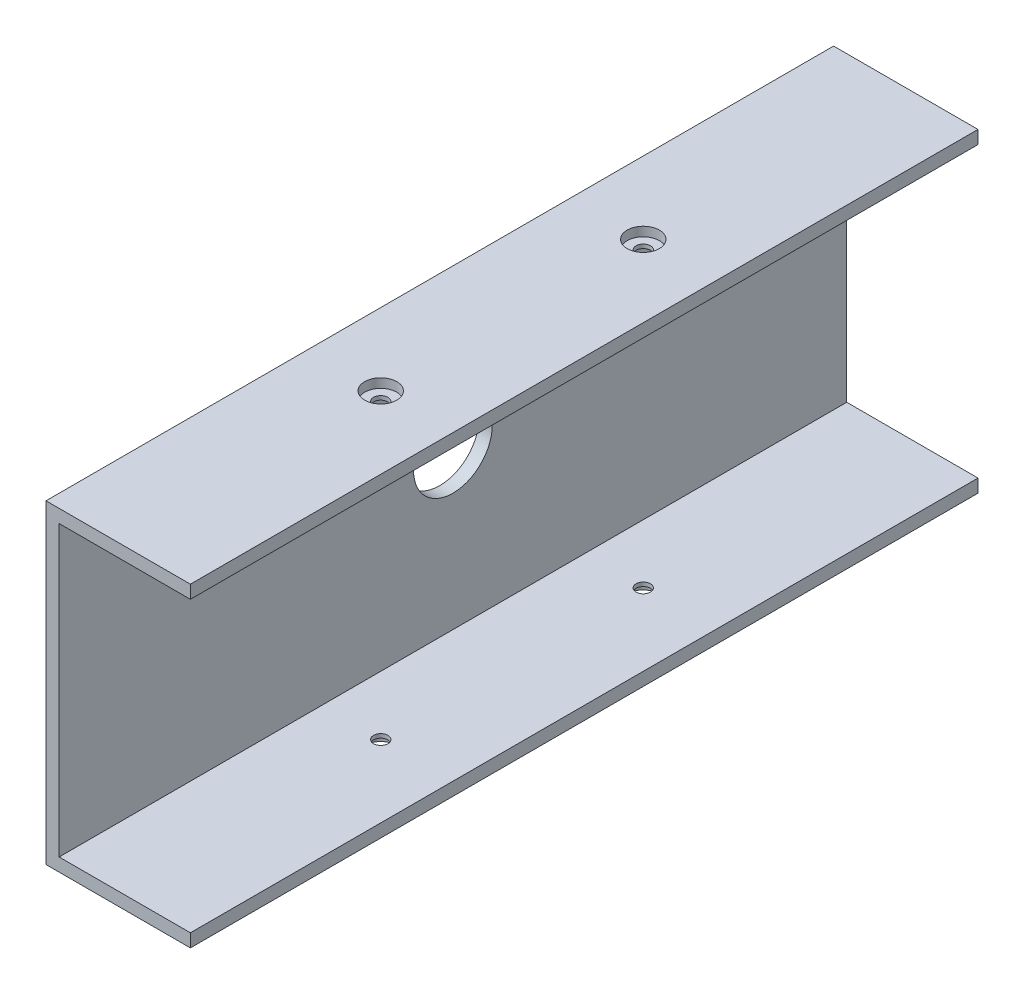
ISO-10303-21;
HEADER;
FILE_DESCRIPTION(('STEP AP214'),'2;1');
FILE_NAME('part.step','',(''),(''),'','','');
FILE_SCHEMA(('AUTOMOTIVE_DESIGN { 1 0 10303 214 1 1 1 1 }'));
ENDSEC;
DATA;
#1=APPLICATION_CONTEXT('core data for automotive mechanical design processes');
#2=APPLICATION_PROTOCOL_DEFINITION('international standard','automotive_design',2000,#1);
#3=PRODUCT_CONTEXT('',#1,'mechanical');
#4=PRODUCT('Part','Part','',(#3));
#5=PRODUCT_RELATED_PRODUCT_CATEGORY('part','',(#4));
#6=PRODUCT_DEFINITION_FORMATION('','',#4);
#7=PRODUCT_DEFINITION_CONTEXT('part definition',#1,'design');
#8=PRODUCT_DEFINITION('design','',#6,#7);
#9=PRODUCT_DEFINITION_SHAPE('','',#8);
#10=(LENGTH_UNIT() NAMED_UNIT(*) SI_UNIT(.MILLI.,.METRE.));
#11=(NAMED_UNIT(*) PLANE_ANGLE_UNIT() SI_UNIT($,.RADIAN.));
#12=(NAMED_UNIT(*) SI_UNIT($,.STERADIAN.) SOLID_ANGLE_UNIT());
#13=UNCERTAINTY_MEASURE_WITH_UNIT(LENGTH_MEASURE(1.E-05),#10,'distance_accuracy_value','');
#14=(GEOMETRIC_REPRESENTATION_CONTEXT(3) GLOBAL_UNCERTAINTY_ASSIGNED_CONTEXT((#13)) GLOBAL_UNIT_ASSIGNED_CONTEXT((#10,
#11,#12)) REPRESENTATION_CONTEXT('',''));
#15=CARTESIAN_POINT('',(0.,0.,0.));
#16=DIRECTION('',(0.,0.,1.));
#17=DIRECTION('',(1.,0.,0.));
#18=AXIS2_PLACEMENT_3D('',#15,#16,#17);
#19=CARTESIAN_POINT('',(-64.668520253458,-52.1779141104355,300.));
#20=DIRECTION('',(1.,0.,0.));
#21=DIRECTION('',(0.,1.,0.));
#22=AXIS2_PLACEMENT_3D('',#19,#20,#21);
#23=PLANE('',#22);
#24=CARTESIAN_POINT('',(-64.668520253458,12.8220858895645,150.));
#25=DIRECTION('',(-1.,0.,0.));
#26=DIRECTION('',(0.,-1.,0.));
#27=AXIS2_PLACEMENT_3D('',#24,#25,#26);
#28=CIRCLE('',#27,15.);
#29=CARTESIAN_POINT('',(-64.668520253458,-2.17791411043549,150.));
#30=VERTEX_POINT('',#29);
#31=EDGE_CURVE('E241',#30,#30,#28,.T.);
#32=ORIENTED_EDGE('',*,*,#31,.F.);
#33=EDGE_LOOP('',(#32));
#34=FACE_BOUND('',#33,.T.);
#35=DIRECTION('',(0.,-1.,0.));
#36=VECTOR('',#35,1.);
#37=CARTESIAN_POINT('',(-64.668520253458,-52.1779141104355,0.));
#38=LINE('',#37,#36);
#39=CARTESIAN_POINT('',(-64.668520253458,67.8220858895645,0.));
#40=VERTEX_POINT('',#39);
#41=CARTESIAN_POINT('',(-64.668520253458,-52.1779141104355,0.));
#42=VERTEX_POINT('',#41);
#43=EDGE_CURVE('E132',#40,#42,#38,.T.);
#44=ORIENTED_EDGE('',*,*,#43,.T.);
#45=DIRECTION('',(0.,0.,-1.));
#46=VECTOR('',#45,1.);
#47=CARTESIAN_POINT('',(-64.668520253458,-52.1779141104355,300.));
#48=LINE('',#47,#46);
#49=CARTESIAN_POINT('',(-64.668520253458,-52.1779141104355,300.));
#50=VERTEX_POINT('',#49);
#51=EDGE_CURVE('E11',#50,#42,#48,.T.);
#52=ORIENTED_EDGE('',*,*,#51,.F.);
#53=DIRECTION('',(0.,-1.,0.));
#54=VECTOR('',#53,1.);
#55=CARTESIAN_POINT('',(-64.668520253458,-52.1779141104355,300.));
#56=LINE('',#55,#54);
#57=CARTESIAN_POINT('',(-64.668520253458,67.8220858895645,300.));
#58=VERTEX_POINT('',#57);
#59=EDGE_CURVE('E147',#58,#50,#56,.T.);
#60=ORIENTED_EDGE('',*,*,#59,.F.);
#61=DIRECTION('',(0.,0.,-1.));
#62=VECTOR('',#61,1.);
#63=CARTESIAN_POINT('',(-64.668520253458,67.8220858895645,300.));
#64=LINE('',#63,#62);
#65=EDGE_CURVE('E128',#58,#40,#64,.T.);
#66=ORIENTED_EDGE('',*,*,#65,.T.);
#67=EDGE_LOOP('',(#44,#52,#60,#66));
#68=FACE_BOUND('',#67,.T.);
#69=ADVANCED_FACE('F34',(#34,#68),#23,.F.);
#70=CARTESIAN_POINT('',(-9.66852025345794,-52.1779141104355,300.));
#71=DIRECTION('',(0.,1.,0.));
#72=DIRECTION('',(-1.,0.,0.));
#73=AXIS2_PLACEMENT_3D('',#70,#71,#72);
#74=PLANE('',#73);
#75=CARTESIAN_POINT('',(-37.1685202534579,-52.1779141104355,100.));
#76=DIRECTION('',(0.,-1.,0.));
#77=DIRECTION('',(0.,0.,-1.));
#78=AXIS2_PLACEMENT_3D('',#75,#76,#77);
#79=CIRCLE('',#78,6.119);
#80=CARTESIAN_POINT('',(-37.1685202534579,-52.1779141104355,93.881));
#81=VERTEX_POINT('',#80);
#82=EDGE_CURVE('E245',#81,#81,#79,.T.);
#83=ORIENTED_EDGE('',*,*,#82,.F.);
#84=EDGE_LOOP('',(#83));
#85=FACE_BOUND('',#84,.T.);
#86=CARTESIAN_POINT('',(-37.1685202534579,-52.1779141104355,200.));
#87=DIRECTION('',(0.,-1.,0.));
#88=DIRECTION('',(0.,0.,-1.));
#89=AXIS2_PLACEMENT_3D('',#86,#87,#88);
#90=CIRCLE('',#89,6.119);
#91=CARTESIAN_POINT('',(-37.1685202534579,-52.1779141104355,193.881));
#92=VERTEX_POINT('',#91);
#93=EDGE_CURVE('E176',#92,#92,#90,.T.);
#94=ORIENTED_EDGE('',*,*,#93,.F.);
#95=EDGE_LOOP('',(#94));
#96=FACE_BOUND('',#95,.T.);
#97=DIRECTION('',(1.,0.,0.));
#98=VECTOR('',#97,1.);
#99=CARTESIAN_POINT('',(-9.66852025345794,-52.1779141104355,0.));
#100=LINE('',#99,#98);
#101=CARTESIAN_POINT('',(-9.66852025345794,-52.1779141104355,0.));
#102=VERTEX_POINT('',#101);
#103=EDGE_CURVE('E135',#42,#102,#100,.T.);
#104=ORIENTED_EDGE('',*,*,#103,.T.);
#105=DIRECTION('',(0.,0.,-1.));
#106=VECTOR('',#105,1.);
#107=CARTESIAN_POINT('',(-9.66852025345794,-52.1779141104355,300.));
#108=LINE('',#107,#106);
#109=CARTESIAN_POINT('',(-9.66852025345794,-52.1779141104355,300.));
#110=VERTEX_POINT('',#109);
#111=EDGE_CURVE('E43',#110,#102,#108,.T.);
#112=ORIENTED_EDGE('',*,*,#111,.F.);
#113=DIRECTION('',(1.,0.,0.));
#114=VECTOR('',#113,1.);
#115=CARTESIAN_POINT('',(-9.66852025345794,-52.1779141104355,300.));
#116=LINE('',#115,#114);
#117=EDGE_CURVE('E95',#50,#110,#116,.T.);
#118=ORIENTED_EDGE('',*,*,#117,.F.);
#119=ORIENTED_EDGE('',*,*,#51,.T.);
#120=EDGE_LOOP('',(#104,#112,#118,#119));
#121=FACE_BOUND('',#120,.T.);
#122=ADVANCED_FACE('F232',(#85,#96,#121),#74,.F.);
#123=CARTESIAN_POINT('',(-9.66852025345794,-47.1779141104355,300.));
#124=DIRECTION('',(-1.,0.,0.));
#125=DIRECTION('',(0.,0.,1.));
#126=AXIS2_PLACEMENT_3D('',#123,#124,#125);
#127=PLANE('',#126);
#128=DIRECTION('',(0.,1.,0.));
#129=VECTOR('',#128,1.);
#130=CARTESIAN_POINT('',(-9.66852025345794,-47.1779141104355,0.));
#131=LINE('',#130,#129);
#132=CARTESIAN_POINT('',(-9.66852025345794,-47.1779141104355,0.));
#133=VERTEX_POINT('',#132);
#134=EDGE_CURVE('E138',#102,#133,#131,.T.);
#135=ORIENTED_EDGE('',*,*,#134,.T.);
#136=DIRECTION('',(0.,0.,-1.));
#137=VECTOR('',#136,1.);
#138=CARTESIAN_POINT('',(-9.66852025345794,-47.1779141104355,300.));
#139=LINE('',#138,#137);
#140=CARTESIAN_POINT('',(-9.66852025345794,-47.1779141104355,300.));
#141=VERTEX_POINT('',#140);
#142=EDGE_CURVE('E154',#141,#133,#139,.T.);
#143=ORIENTED_EDGE('',*,*,#142,.F.);
#144=DIRECTION('',(0.,1.,0.));
#145=VECTOR('',#144,1.);
#146=CARTESIAN_POINT('',(-9.66852025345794,-47.1779141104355,300.));
#147=LINE('',#146,#145);
#148=EDGE_CURVE('E198',#110,#141,#147,.T.);
#149=ORIENTED_EDGE('',*,*,#148,.F.);
#150=ORIENTED_EDGE('',*,*,#111,.T.);
#151=EDGE_LOOP('',(#135,#143,#149,#150));
#152=FACE_BOUND('',#151,.T.);
#153=ADVANCED_FACE('F237',(#152),#127,.F.);
#154=CARTESIAN_POINT('',(-59.6685202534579,-47.1779141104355,300.));
#155=DIRECTION('',(0.,-1.,0.));
#156=DIRECTION('',(0.,0.,-1.));
#157=AXIS2_PLACEMENT_3D('',#154,#155,#156);
#158=PLANE('',#157);
#159=CARTESIAN_POINT('',(-37.1685202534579,-47.1779141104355,100.));
#160=DIRECTION('',(0.,-1.,0.));
#161=DIRECTION('',(0.,0.,-1.));
#162=AXIS2_PLACEMENT_3D('',#159,#160,#161);
#163=CIRCLE('',#162,2.75);
#164=CARTESIAN_POINT('',(-37.1685202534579,-47.1779141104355,97.25));
#165=VERTEX_POINT('',#164);
#166=EDGE_CURVE('E249',#165,#165,#163,.T.);
#167=ORIENTED_EDGE('',*,*,#166,.T.);
#168=EDGE_LOOP('',(#167));
#169=FACE_BOUND('',#168,.T.);
#170=CARTESIAN_POINT('',(-37.1685202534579,-47.1779141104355,200.));
#171=DIRECTION('',(0.,-1.,0.));
#172=DIRECTION('',(0.,0.,-1.));
#173=AXIS2_PLACEMENT_3D('',#170,#171,#172);
#174=CIRCLE('',#173,2.75);
#175=CARTESIAN_POINT('',(-37.1685202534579,-47.1779141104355,197.25));
#176=VERTEX_POINT('',#175);
#177=EDGE_CURVE('E161',#176,#176,#174,.T.);
#178=ORIENTED_EDGE('',*,*,#177,.T.);
#179=EDGE_LOOP('',(#178));
#180=FACE_BOUND('',#179,.T.);
#181=DIRECTION('',(-1.,0.,0.));
#182=VECTOR('',#181,1.);
#183=CARTESIAN_POINT('',(-59.6685202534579,-47.1779141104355,0.));
#184=LINE('',#183,#182);
#185=CARTESIAN_POINT('',(-59.6685202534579,-47.1779141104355,0.));
#186=VERTEX_POINT('',#185);
#187=EDGE_CURVE('E140',#133,#186,#184,.T.);
#188=ORIENTED_EDGE('',*,*,#187,.T.);
#189=DIRECTION('',(0.,0.,-1.));
#190=VECTOR('',#189,1.);
#191=CARTESIAN_POINT('',(-59.6685202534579,-47.1779141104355,300.));
#192=LINE('',#191,#190);
#193=CARTESIAN_POINT('',(-59.6685202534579,-47.1779141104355,300.));
#194=VERTEX_POINT('',#193);
#195=EDGE_CURVE('E151',#194,#186,#192,.T.);
#196=ORIENTED_EDGE('',*,*,#195,.F.);
#197=DIRECTION('',(-1.,0.,0.));
#198=VECTOR('',#197,1.);
#199=CARTESIAN_POINT('',(-59.6685202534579,-47.1779141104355,300.));
#200=LINE('',#199,#198);
#201=EDGE_CURVE('E200',#141,#194,#200,.T.);
#202=ORIENTED_EDGE('',*,*,#201,.F.);
#203=ORIENTED_EDGE('',*,*,#142,.T.);
#204=EDGE_LOOP('',(#188,#196,#202,#203));
#205=FACE_BOUND('',#204,.T.);
#206=ADVANCED_FACE('F206',(#169,#180,#205),#158,.F.);
#207=CARTESIAN_POINT('',(-59.6685202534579,62.8220858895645,300.));
#208=DIRECTION('',(-1.,0.,0.));
#209=DIRECTION('',(0.,-1.,0.));
#210=AXIS2_PLACEMENT_3D('',#207,#208,#209);
#211=PLANE('',#210);
#212=CARTESIAN_POINT('',(-59.6685202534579,12.8220858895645,150.));
#213=DIRECTION('',(-1.,0.,0.));
#214=DIRECTION('',(0.,-1.,0.));
#215=AXIS2_PLACEMENT_3D('',#212,#213,#214);
#216=CIRCLE('',#215,15.);
#217=CARTESIAN_POINT('',(-59.6685202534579,-2.17791411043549,150.));
#218=VERTEX_POINT('',#217);
#219=EDGE_CURVE('E37',#218,#218,#216,.T.);
#220=ORIENTED_EDGE('',*,*,#219,.T.);
#221=EDGE_LOOP('',(#220));
#222=FACE_BOUND('',#221,.T.);
#223=DIRECTION('',(0.,1.,0.));
#224=VECTOR('',#223,1.);
#225=CARTESIAN_POINT('',(-59.6685202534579,62.8220858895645,0.));
#226=LINE('',#225,#224);
#227=CARTESIAN_POINT('',(-59.6685202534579,62.8220858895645,0.));
#228=VERTEX_POINT('',#227);
#229=EDGE_CURVE('E142',#186,#228,#226,.T.);
#230=ORIENTED_EDGE('',*,*,#229,.T.);
#231=DIRECTION('',(0.,0.,-1.));
#232=VECTOR('',#231,1.);
#233=CARTESIAN_POINT('',(-59.6685202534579,62.8220858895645,300.));
#234=LINE('',#233,#232);
#235=CARTESIAN_POINT('',(-59.6685202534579,62.8220858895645,300.));
#236=VERTEX_POINT('',#235);
#237=EDGE_CURVE('E123',#236,#228,#234,.T.);
#238=ORIENTED_EDGE('',*,*,#237,.F.);
#239=DIRECTION('',(0.,1.,0.));
#240=VECTOR('',#239,1.);
#241=CARTESIAN_POINT('',(-59.6685202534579,62.8220858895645,300.));
#242=LINE('',#241,#240);
#243=EDGE_CURVE('E114',#194,#236,#242,.T.);
#244=ORIENTED_EDGE('',*,*,#243,.F.);
#245=ORIENTED_EDGE('',*,*,#195,.T.);
#246=EDGE_LOOP('',(#230,#238,#244,#245));
#247=FACE_BOUND('',#246,.T.);
#248=ADVANCED_FACE('F210',(#222,#247),#211,.F.);
#249=CARTESIAN_POINT('',(-9.66852025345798,62.8220858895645,300.));
#250=DIRECTION('',(0.,1.,0.));
#251=DIRECTION('',(-1.,0.,0.));
#252=AXIS2_PLACEMENT_3D('',#249,#250,#251);
#253=PLANE('',#252);
#254=CARTESIAN_POINT('',(-37.168520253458,62.8220858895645,100.));
#255=DIRECTION('',(0.,1.,0.));
#256=DIRECTION('',(-1.,0.,0.));
#257=AXIS2_PLACEMENT_3D('',#254,#255,#256);
#258=CIRCLE('',#257,2.75);
#259=CARTESIAN_POINT('',(-39.918520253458,62.8220858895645,100.));
#260=VERTEX_POINT('',#259);
#261=EDGE_CURVE('E168',#260,#260,#258,.T.);
#262=ORIENTED_EDGE('',*,*,#261,.T.);
#263=EDGE_LOOP('',(#262));
#264=FACE_BOUND('',#263,.T.);
#265=CARTESIAN_POINT('',(-37.168520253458,62.8220858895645,200.));
#266=DIRECTION('',(0.,1.,0.));
#267=DIRECTION('',(-1.,0.,0.));
#268=AXIS2_PLACEMENT_3D('',#265,#266,#267);
#269=CIRCLE('',#268,2.75);
#270=CARTESIAN_POINT('',(-39.918520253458,62.8220858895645,200.));
#271=VERTEX_POINT('',#270);
#272=EDGE_CURVE('E136',#271,#271,#269,.T.);
#273=ORIENTED_EDGE('',*,*,#272,.T.);
#274=EDGE_LOOP('',(#273));
#275=FACE_BOUND('',#274,.T.);
#276=DIRECTION('',(1.,0.,0.));
#277=VECTOR('',#276,1.);
#278=CARTESIAN_POINT('',(-9.66852025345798,62.8220858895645,0.));
#279=LINE('',#278,#277);
#280=CARTESIAN_POINT('',(-9.66852025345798,62.8220858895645,0.));
#281=VERTEX_POINT('',#280);
#282=EDGE_CURVE('E122',#228,#281,#279,.T.);
#283=ORIENTED_EDGE('',*,*,#282,.T.);
#284=DIRECTION('',(0.,0.,-1.));
#285=VECTOR('',#284,1.);
#286=CARTESIAN_POINT('',(-9.66852025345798,62.8220858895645,300.));
#287=LINE('',#286,#285);
#288=CARTESIAN_POINT('',(-9.66852025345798,62.8220858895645,300.));
#289=VERTEX_POINT('',#288);
#290=EDGE_CURVE('E119',#289,#281,#287,.T.);
#291=ORIENTED_EDGE('',*,*,#290,.F.);
#292=DIRECTION('',(1.,0.,0.));
#293=VECTOR('',#292,1.);
#294=CARTESIAN_POINT('',(-9.66852025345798,62.8220858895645,300.));
#295=LINE('',#294,#293);
#296=EDGE_CURVE('E108',#236,#289,#295,.T.);
#297=ORIENTED_EDGE('',*,*,#296,.F.);
#298=ORIENTED_EDGE('',*,*,#237,.T.);
#299=EDGE_LOOP('',(#283,#291,#297,#298));
#300=FACE_BOUND('',#299,.T.);
#301=ADVANCED_FACE('F120',(#264,#275,#300),#253,.F.);
#302=CARTESIAN_POINT('',(-9.66852025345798,67.8220858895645,300.));
#303=DIRECTION('',(-1.,0.,0.));
#304=DIRECTION('',(0.,0.,1.));
#305=AXIS2_PLACEMENT_3D('',#302,#303,#304);
#306=PLANE('',#305);
#307=DIRECTION('',(0.,1.,0.));
#308=VECTOR('',#307,1.);
#309=CARTESIAN_POINT('',(-9.66852025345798,67.8220858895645,0.));
#310=LINE('',#309,#308);
#311=CARTESIAN_POINT('',(-9.66852025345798,67.8220858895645,0.));
#312=VERTEX_POINT('',#311);
#313=EDGE_CURVE('E81',#281,#312,#310,.T.);
#314=ORIENTED_EDGE('',*,*,#313,.T.);
#315=DIRECTION('',(0.,0.,-1.));
#316=VECTOR('',#315,1.);
#317=CARTESIAN_POINT('',(-9.66852025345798,67.8220858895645,300.));
#318=LINE('',#317,#316);
#319=CARTESIAN_POINT('',(-9.66852025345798,67.8220858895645,300.));
#320=VERTEX_POINT('',#319);
#321=EDGE_CURVE('E124',#320,#312,#318,.T.);
#322=ORIENTED_EDGE('',*,*,#321,.F.);
#323=DIRECTION('',(0.,1.,0.));
#324=VECTOR('',#323,1.);
#325=CARTESIAN_POINT('',(-9.66852025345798,67.8220858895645,300.));
#326=LINE('',#325,#324);
#327=EDGE_CURVE('E112',#289,#320,#326,.T.);
#328=ORIENTED_EDGE('',*,*,#327,.F.);
#329=ORIENTED_EDGE('',*,*,#290,.T.);
#330=EDGE_LOOP('',(#314,#322,#328,#329));
#331=FACE_BOUND('',#330,.T.);
#332=ADVANCED_FACE('F126',(#331),#306,.F.);
#333=CARTESIAN_POINT('',(-64.668520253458,67.8220858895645,300.));
#334=DIRECTION('',(0.,-1.,0.));
#335=DIRECTION('',(1.,0.,0.));
#336=AXIS2_PLACEMENT_3D('',#333,#334,#335);
#337=PLANE('',#336);
#338=CARTESIAN_POINT('',(-37.168520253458,67.8220858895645,100.));
#339=DIRECTION('',(0.,1.,0.));
#340=DIRECTION('',(0.,0.,1.));
#341=AXIS2_PLACEMENT_3D('',#338,#339,#340);
#342=CIRCLE('',#341,6.119);
#343=CARTESIAN_POINT('',(-37.168520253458,67.8220858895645,106.119));
#344=VERTEX_POINT('',#343);
#345=EDGE_CURVE('E163',#344,#344,#342,.T.);
#346=ORIENTED_EDGE('',*,*,#345,.F.);
#347=EDGE_LOOP('',(#346));
#348=FACE_BOUND('',#347,.T.);
#349=CARTESIAN_POINT('',(-37.168520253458,67.8220858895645,200.));
#350=DIRECTION('',(0.,1.,0.));
#351=DIRECTION('',(0.,0.,1.));
#352=AXIS2_PLACEMENT_3D('',#349,#350,#351);
#353=CIRCLE('',#352,6.119);
#354=CARTESIAN_POINT('',(-37.168520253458,67.8220858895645,206.119));
#355=VERTEX_POINT('',#354);
#356=EDGE_CURVE('E188',#355,#355,#353,.T.);
#357=ORIENTED_EDGE('',*,*,#356,.F.);
#358=EDGE_LOOP('',(#357));
#359=FACE_BOUND('',#358,.T.);
#360=DIRECTION('',(-1.,0.,0.));
#361=VECTOR('',#360,1.);
#362=CARTESIAN_POINT('',(-64.668520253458,67.8220858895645,0.));
#363=LINE('',#362,#361);
#364=EDGE_CURVE('E87',#312,#40,#363,.T.);
#365=ORIENTED_EDGE('',*,*,#364,.T.);
#366=ORIENTED_EDGE('',*,*,#65,.F.);
#367=DIRECTION('',(-1.,0.,0.));
#368=VECTOR('',#367,1.);
#369=CARTESIAN_POINT('',(-64.668520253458,67.8220858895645,300.));
#370=LINE('',#369,#368);
#371=EDGE_CURVE('E52',#320,#58,#370,.T.);
#372=ORIENTED_EDGE('',*,*,#371,.F.);
#373=ORIENTED_EDGE('',*,*,#321,.T.);
#374=EDGE_LOOP('',(#365,#366,#372,#373));
#375=FACE_BOUND('',#374,.T.);
#376=ADVANCED_FACE('F218',(#348,#359,#375),#337,.F.);
#377=CARTESIAN_POINT('',(0.,0.,300.));
#378=DIRECTION('',(0.,0.,-1.));
#379=DIRECTION('',(-1.,0.,0.));
#380=AXIS2_PLACEMENT_3D('',#377,#378,#379);
#381=PLANE('',#380);
#382=ORIENTED_EDGE('',*,*,#59,.T.);
#383=ORIENTED_EDGE('',*,*,#117,.T.);
#384=ORIENTED_EDGE('',*,*,#148,.T.);
#385=ORIENTED_EDGE('',*,*,#201,.T.);
#386=ORIENTED_EDGE('',*,*,#243,.T.);
#387=ORIENTED_EDGE('',*,*,#296,.T.);
#388=ORIENTED_EDGE('',*,*,#327,.T.);
#389=ORIENTED_EDGE('',*,*,#371,.T.);
#390=EDGE_LOOP('',(#382,#383,#384,#385,#386,#387,#388,#389));
#391=FACE_BOUND('',#390,.T.);
#392=ADVANCED_FACE('F110',(#391),#381,.F.);
#393=CARTESIAN_POINT('',(0.,0.,0.));
#394=DIRECTION('',(0.,0.,-1.));
#395=DIRECTION('',(-1.,0.,0.));
#396=AXIS2_PLACEMENT_3D('',#393,#394,#395);
#397=PLANE('',#396);
#398=ORIENTED_EDGE('',*,*,#43,.F.);
#399=ORIENTED_EDGE('',*,*,#364,.F.);
#400=ORIENTED_EDGE('',*,*,#313,.F.);
#401=ORIENTED_EDGE('',*,*,#282,.F.);
#402=ORIENTED_EDGE('',*,*,#229,.F.);
#403=ORIENTED_EDGE('',*,*,#187,.F.);
#404=ORIENTED_EDGE('',*,*,#134,.F.);
#405=ORIENTED_EDGE('',*,*,#103,.F.);
#406=EDGE_LOOP('',(#398,#399,#400,#401,#402,#403,#404,#405));
#407=FACE_BOUND('',#406,.T.);
#408=ADVANCED_FACE('F213',(#407),#397,.T.);
#409=CARTESIAN_POINT('',(-37.168520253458,67.8220858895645,200.));
#410=DIRECTION('',(0.,1.,0.));
#411=DIRECTION('',(0.,0.,1.));
#412=AXIS2_PLACEMENT_3D('',#409,#410,#411);
#413=CYLINDRICAL_SURFACE('',#412,2.75);
#414=CARTESIAN_POINT('',(-37.168520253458,64.3220858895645,200.));
#415=DIRECTION('',(0.,1.,0.));
#416=DIRECTION('',(0.,0.,1.));
#417=AXIS2_PLACEMENT_3D('',#414,#415,#416);
#418=CIRCLE('',#417,2.75);
#419=CARTESIAN_POINT('',(-37.168520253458,64.3220858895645,202.75));
#420=VERTEX_POINT('',#419);
#421=EDGE_CURVE('E160',#420,#420,#418,.T.);
#422=ORIENTED_EDGE('',*,*,#421,.T.);
#423=EDGE_LOOP('',(#422));
#424=FACE_BOUND('',#423,.T.);
#425=ORIENTED_EDGE('',*,*,#272,.F.);
#426=EDGE_LOOP('',(#425));
#427=FACE_BOUND('',#426,.T.);
#428=ADVANCED_FACE('F282',(#424,#427),#413,.F.);
#429=CARTESIAN_POINT('',(-34.418520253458,64.3220858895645,200.));
#430=DIRECTION('',(0.,-1.,0.));
#431=DIRECTION('',(0.,0.,-1.));
#432=AXIS2_PLACEMENT_3D('',#429,#430,#431);
#433=PLANE('',#432);
#434=ORIENTED_EDGE('',*,*,#421,.F.);
#435=EDGE_LOOP('',(#434));
#436=FACE_BOUND('',#435,.T.);
#437=CARTESIAN_POINT('',(-37.168520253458,64.3220858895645,200.));
#438=DIRECTION('',(0.,1.,0.));
#439=DIRECTION('',(0.,0.,1.));
#440=AXIS2_PLACEMENT_3D('',#437,#438,#439);
#441=CIRCLE('',#440,6.119);
#442=CARTESIAN_POINT('',(-37.168520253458,64.3220858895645,206.119));
#443=VERTEX_POINT('',#442);
#444=EDGE_CURVE('E191',#443,#443,#441,.T.);
#445=ORIENTED_EDGE('',*,*,#444,.T.);
#446=EDGE_LOOP('',(#445));
#447=FACE_BOUND('',#446,.T.);
#448=ADVANCED_FACE('F284',(#436,#447),#433,.F.);
#449=CARTESIAN_POINT('',(-37.168520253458,67.8220858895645,200.));
#450=DIRECTION('',(0.,1.,0.));
#451=DIRECTION('',(0.,0.,1.));
#452=AXIS2_PLACEMENT_3D('',#449,#450,#451);
#453=CYLINDRICAL_SURFACE('',#452,6.119);
#454=ORIENTED_EDGE('',*,*,#444,.F.);
#455=EDGE_LOOP('',(#454));
#456=FACE_BOUND('',#455,.T.);
#457=ORIENTED_EDGE('',*,*,#356,.T.);
#458=EDGE_LOOP('',(#457));
#459=FACE_BOUND('',#458,.T.);
#460=ADVANCED_FACE('F291',(#456,#459),#453,.F.);
#461=CARTESIAN_POINT('',(-37.168520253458,67.8220858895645,100.));
#462=DIRECTION('',(0.,1.,0.));
#463=DIRECTION('',(0.,0.,1.));
#464=AXIS2_PLACEMENT_3D('',#461,#462,#463);
#465=CYLINDRICAL_SURFACE('',#464,2.75);
#466=CARTESIAN_POINT('',(-37.168520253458,64.3220858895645,100.));
#467=DIRECTION('',(0.,1.,0.));
#468=DIRECTION('',(0.,0.,1.));
#469=AXIS2_PLACEMENT_3D('',#466,#467,#468);
#470=CIRCLE('',#469,2.75);
#471=CARTESIAN_POINT('',(-37.168520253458,64.3220858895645,102.75));
#472=VERTEX_POINT('',#471);
#473=EDGE_CURVE('E185',#472,#472,#470,.T.);
#474=ORIENTED_EDGE('',*,*,#473,.T.);
#475=EDGE_LOOP('',(#474));
#476=FACE_BOUND('',#475,.T.);
#477=ORIENTED_EDGE('',*,*,#261,.F.);
#478=EDGE_LOOP('',(#477));
#479=FACE_BOUND('',#478,.T.);
#480=ADVANCED_FACE('F297',(#476,#479),#465,.F.);
#481=CARTESIAN_POINT('',(-34.418520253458,64.3220858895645,100.));
#482=DIRECTION('',(0.,-1.,0.));
#483=DIRECTION('',(0.,0.,-1.));
#484=AXIS2_PLACEMENT_3D('',#481,#482,#483);
#485=PLANE('',#484);
#486=ORIENTED_EDGE('',*,*,#473,.F.);
#487=EDGE_LOOP('',(#486));
#488=FACE_BOUND('',#487,.T.);
#489=CARTESIAN_POINT('',(-37.168520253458,64.3220858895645,100.));
#490=DIRECTION('',(0.,1.,0.));
#491=DIRECTION('',(0.,0.,1.));
#492=AXIS2_PLACEMENT_3D('',#489,#490,#491);
#493=CIRCLE('',#492,6.119);
#494=CARTESIAN_POINT('',(-37.168520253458,64.3220858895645,106.119));
#495=VERTEX_POINT('',#494);
#496=EDGE_CURVE('E182',#495,#495,#493,.T.);
#497=ORIENTED_EDGE('',*,*,#496,.T.);
#498=EDGE_LOOP('',(#497));
#499=FACE_BOUND('',#498,.T.);
#500=ADVANCED_FACE('F301',(#488,#499),#485,.F.);
#501=CARTESIAN_POINT('',(-37.168520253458,67.8220858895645,100.));
#502=DIRECTION('',(0.,1.,0.));
#503=DIRECTION('',(0.,0.,1.));
#504=AXIS2_PLACEMENT_3D('',#501,#502,#503);
#505=CYLINDRICAL_SURFACE('',#504,6.119);
#506=ORIENTED_EDGE('',*,*,#496,.F.);
#507=EDGE_LOOP('',(#506));
#508=FACE_BOUND('',#507,.T.);
#509=ORIENTED_EDGE('',*,*,#345,.T.);
#510=EDGE_LOOP('',(#509));
#511=FACE_BOUND('',#510,.T.);
#512=ADVANCED_FACE('F305',(#508,#511),#505,.F.);
#513=CARTESIAN_POINT('',(-37.1685202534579,-52.1779141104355,200.));
#514=DIRECTION('',(0.,-1.,0.));
#515=DIRECTION('',(0.,0.,-1.));
#516=AXIS2_PLACEMENT_3D('',#513,#514,#515);
#517=CYLINDRICAL_SURFACE('',#516,2.75);
#518=CARTESIAN_POINT('',(-37.1685202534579,-48.6779141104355,200.));
#519=DIRECTION('',(0.,-1.,0.));
#520=DIRECTION('',(0.,0.,-1.));
#521=AXIS2_PLACEMENT_3D('',#518,#519,#520);
#522=CIRCLE('',#521,2.75);
#523=CARTESIAN_POINT('',(-37.1685202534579,-48.6779141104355,197.25));
#524=VERTEX_POINT('',#523);
#525=EDGE_CURVE('E164',#524,#524,#522,.T.);
#526=ORIENTED_EDGE('',*,*,#525,.T.);
#527=EDGE_LOOP('',(#526));
#528=FACE_BOUND('',#527,.T.);
#529=ORIENTED_EDGE('',*,*,#177,.F.);
#530=EDGE_LOOP('',(#529));
#531=FACE_BOUND('',#530,.T.);
#532=ADVANCED_FACE('F309',(#528,#531),#517,.F.);
#533=CARTESIAN_POINT('',(-34.4185202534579,-48.6779141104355,200.));
#534=DIRECTION('',(0.,1.,0.));
#535=DIRECTION('',(0.,0.,1.));
#536=AXIS2_PLACEMENT_3D('',#533,#534,#535);
#537=PLANE('',#536);
#538=ORIENTED_EDGE('',*,*,#525,.F.);
#539=EDGE_LOOP('',(#538));
#540=FACE_BOUND('',#539,.T.);
#541=CARTESIAN_POINT('',(-37.1685202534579,-48.6779141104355,200.));
#542=DIRECTION('',(0.,-1.,0.));
#543=DIRECTION('',(0.,0.,-1.));
#544=AXIS2_PLACEMENT_3D('',#541,#542,#543);
#545=CIRCLE('',#544,6.119);
#546=CARTESIAN_POINT('',(-37.1685202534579,-48.6779141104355,193.881));
#547=VERTEX_POINT('',#546);
#548=EDGE_CURVE('E171',#547,#547,#545,.T.);
#549=ORIENTED_EDGE('',*,*,#548,.T.);
#550=EDGE_LOOP('',(#549));
#551=FACE_BOUND('',#550,.T.);
#552=ADVANCED_FACE('F313',(#540,#551),#537,.F.);
#553=CARTESIAN_POINT('',(-37.1685202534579,-52.1779141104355,200.));
#554=DIRECTION('',(0.,-1.,0.));
#555=DIRECTION('',(0.,0.,-1.));
#556=AXIS2_PLACEMENT_3D('',#553,#554,#555);
#557=CYLINDRICAL_SURFACE('',#556,6.119);
#558=ORIENTED_EDGE('',*,*,#548,.F.);
#559=EDGE_LOOP('',(#558));
#560=FACE_BOUND('',#559,.T.);
#561=ORIENTED_EDGE('',*,*,#93,.T.);
#562=EDGE_LOOP('',(#561));
#563=FACE_BOUND('',#562,.T.);
#564=ADVANCED_FACE('F260',(#560,#563),#557,.F.);
#565=CARTESIAN_POINT('',(-37.1685202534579,-52.1779141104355,100.));
#566=DIRECTION('',(0.,-1.,0.));
#567=DIRECTION('',(0.,0.,-1.));
#568=AXIS2_PLACEMENT_3D('',#565,#566,#567);
#569=CYLINDRICAL_SURFACE('',#568,2.75);
#570=CARTESIAN_POINT('',(-37.1685202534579,-48.6779141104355,100.));
#571=DIRECTION('',(0.,-1.,0.));
#572=DIRECTION('',(0.,0.,-1.));
#573=AXIS2_PLACEMENT_3D('',#570,#571,#572);
#574=CIRCLE('',#573,2.75);
#575=CARTESIAN_POINT('',(-37.1685202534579,-48.6779141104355,97.25));
#576=VERTEX_POINT('',#575);
#577=EDGE_CURVE('E255',#576,#576,#574,.T.);
#578=ORIENTED_EDGE('',*,*,#577,.T.);
#579=EDGE_LOOP('',(#578));
#580=FACE_BOUND('',#579,.T.);
#581=ORIENTED_EDGE('',*,*,#166,.F.);
#582=EDGE_LOOP('',(#581));
#583=FACE_BOUND('',#582,.T.);
#584=ADVANCED_FACE('F319',(#580,#583),#569,.F.);
#585=CARTESIAN_POINT('',(-34.4185202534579,-48.6779141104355,100.));
#586=DIRECTION('',(0.,1.,0.));
#587=DIRECTION('',(0.,0.,1.));
#588=AXIS2_PLACEMENT_3D('',#585,#586,#587);
#589=PLANE('',#588);
#590=ORIENTED_EDGE('',*,*,#577,.F.);
#591=EDGE_LOOP('',(#590));
#592=FACE_BOUND('',#591,.T.);
#593=CARTESIAN_POINT('',(-37.1685202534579,-48.6779141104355,100.));
#594=DIRECTION('',(0.,-1.,0.));
#595=DIRECTION('',(0.,0.,-1.));
#596=AXIS2_PLACEMENT_3D('',#593,#594,#595);
#597=CIRCLE('',#596,6.119);
#598=CARTESIAN_POINT('',(-37.1685202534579,-48.6779141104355,93.881));
#599=VERTEX_POINT('',#598);
#600=EDGE_CURVE('E252',#599,#599,#597,.T.);
#601=ORIENTED_EDGE('',*,*,#600,.T.);
#602=EDGE_LOOP('',(#601));
#603=FACE_BOUND('',#602,.T.);
#604=ADVANCED_FACE('F323',(#592,#603),#589,.F.);
#605=CARTESIAN_POINT('',(-37.1685202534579,-52.1779141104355,100.));
#606=DIRECTION('',(0.,-1.,0.));
#607=DIRECTION('',(0.,0.,-1.));
#608=AXIS2_PLACEMENT_3D('',#605,#606,#607);
#609=CYLINDRICAL_SURFACE('',#608,6.119);
#610=ORIENTED_EDGE('',*,*,#600,.F.);
#611=EDGE_LOOP('',(#610));
#612=FACE_BOUND('',#611,.T.);
#613=ORIENTED_EDGE('',*,*,#82,.T.);
#614=EDGE_LOOP('',(#613));
#615=FACE_BOUND('',#614,.T.);
#616=ADVANCED_FACE('F327',(#612,#615),#609,.F.);
#617=CARTESIAN_POINT('',(-9.66852025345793,12.8220858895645,150.));
#618=DIRECTION('',(-1.,0.,0.));
#619=DIRECTION('',(0.,-1.,0.));
#620=AXIS2_PLACEMENT_3D('',#617,#618,#619);
#621=CYLINDRICAL_SURFACE('',#620,15.);
#622=ORIENTED_EDGE('',*,*,#31,.T.);
#623=EDGE_LOOP('',(#622));
#624=FACE_BOUND('',#623,.T.);
#625=ORIENTED_EDGE('',*,*,#219,.F.);
#626=EDGE_LOOP('',(#625));
#627=FACE_BOUND('',#626,.T.);
#628=ADVANCED_FACE('F331',(#624,#627),#621,.F.);
#629=CLOSED_SHELL('',(#69,#122,#153,#206,#248,#301,#332,#376,#392,#408,#428,#448,#460,#480,#500,
#512,#532,#552,#564,#584,#604,#616,#628));
#630=MANIFOLD_SOLID_BREP('B2',#629);
#631=ADVANCED_BREP_SHAPE_REPRESENTATION('',(#18,#630),#14);
#632=SHAPE_DEFINITION_REPRESENTATION(#9,#631);
ENDSEC;
END-ISO-10303-21;
